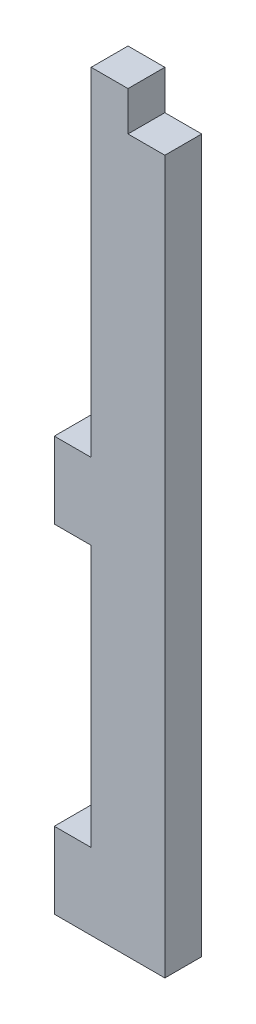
ISO-10303-21;
HEADER;
FILE_DESCRIPTION(('STEP AP214'),'2;1');
FILE_NAME('part.step','',(''),(''),'','','');
FILE_SCHEMA(('AUTOMOTIVE_DESIGN { 1 0 10303 214 1 1 1 1 }'));
ENDSEC;
DATA;
#1=APPLICATION_CONTEXT('core data for automotive mechanical design processes');
#2=APPLICATION_PROTOCOL_DEFINITION('international standard','automotive_design',2000,#1);
#3=PRODUCT_CONTEXT('',#1,'mechanical');
#4=PRODUCT('Part','Part','',(#3));
#5=PRODUCT_RELATED_PRODUCT_CATEGORY('part','',(#4));
#6=PRODUCT_DEFINITION_FORMATION('','',#4);
#7=PRODUCT_DEFINITION_CONTEXT('part definition',#1,'design');
#8=PRODUCT_DEFINITION('design','',#6,#7);
#9=PRODUCT_DEFINITION_SHAPE('','',#8);
#10=(LENGTH_UNIT() NAMED_UNIT(*) SI_UNIT(.MILLI.,.METRE.));
#11=(NAMED_UNIT(*) PLANE_ANGLE_UNIT() SI_UNIT($,.RADIAN.));
#12=(NAMED_UNIT(*) SI_UNIT($,.STERADIAN.) SOLID_ANGLE_UNIT());
#13=UNCERTAINTY_MEASURE_WITH_UNIT(LENGTH_MEASURE(1.E-05),#10,'distance_accuracy_value','');
#14=(GEOMETRIC_REPRESENTATION_CONTEXT(3) GLOBAL_UNCERTAINTY_ASSIGNED_CONTEXT((#13)) GLOBAL_UNIT_ASSIGNED_CONTEXT((#10,
#11,#12)) REPRESENTATION_CONTEXT('',''));
#15=CARTESIAN_POINT('',(0.,0.,0.));
#16=DIRECTION('',(0.,0.,1.));
#17=DIRECTION('',(1.,0.,0.));
#18=AXIS2_PLACEMENT_3D('',#15,#16,#17);
#19=CARTESIAN_POINT('',(0.,-68.9,3.));
#20=DIRECTION('',(0.,-1.,0.));
#21=DIRECTION('',(0.,0.,-1.));
#22=AXIS2_PLACEMENT_3D('',#19,#20,#21);
#23=PLANE('',#22);
#24=DIRECTION('',(-1.,0.,0.));
#25=VECTOR('',#24,1.);
#26=CARTESIAN_POINT('',(0.,-68.9,0.));
#27=LINE('',#26,#25);
#28=CARTESIAN_POINT('',(0.,-68.9,0.));
#29=VERTEX_POINT('',#28);
#30=CARTESIAN_POINT('',(-3.,-68.9,0.));
#31=VERTEX_POINT('',#30);
#32=EDGE_CURVE('E140',#29,#31,#27,.T.);
#33=ORIENTED_EDGE('',*,*,#32,.T.);
#34=DIRECTION('',(0.,0.,-1.));
#35=VECTOR('',#34,1.);
#36=CARTESIAN_POINT('',(-3.,-68.9,3.));
#37=LINE('',#36,#35);
#38=CARTESIAN_POINT('',(-3.,-68.9,3.));
#39=VERTEX_POINT('',#38);
#40=EDGE_CURVE('E11',#39,#31,#37,.T.);
#41=ORIENTED_EDGE('',*,*,#40,.F.);
#42=DIRECTION('',(-1.,0.,0.));
#43=VECTOR('',#42,1.);
#44=CARTESIAN_POINT('',(0.,-68.9,3.));
#45=LINE('',#44,#43);
#46=CARTESIAN_POINT('',(0.,-68.9,3.));
#47=VERTEX_POINT('',#46);
#48=EDGE_CURVE('E244',#47,#39,#45,.T.);
#49=ORIENTED_EDGE('',*,*,#48,.F.);
#50=DIRECTION('',(0.,0.,-1.));
#51=VECTOR('',#50,1.);
#52=CARTESIAN_POINT('',(0.,-68.9,3.));
#53=LINE('',#52,#51);
#54=EDGE_CURVE('E33',#47,#29,#53,.T.);
#55=ORIENTED_EDGE('',*,*,#54,.T.);
#56=EDGE_LOOP('',(#33,#41,#49,#55));
#57=FACE_BOUND('',#56,.T.);
#58=ADVANCED_FACE('F17',(#57),#23,.F.);
#59=CARTESIAN_POINT('',(-2.99999999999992,0.,3.));
#60=DIRECTION('',(1.,0.,0.));
#61=DIRECTION('',(0.,1.,0.));
#62=AXIS2_PLACEMENT_3D('',#59,#60,#61);
#63=PLANE('',#62);
#64=DIRECTION('',(0.,-1.,0.));
#65=VECTOR('',#64,1.);
#66=CARTESIAN_POINT('',(-2.99999999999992,0.,0.));
#67=LINE('',#66,#65);
#68=CARTESIAN_POINT('',(-3.,-75.1,0.));
#69=VERTEX_POINT('',#68);
#70=EDGE_CURVE('E142',#31,#69,#67,.T.);
#71=ORIENTED_EDGE('',*,*,#70,.T.);
#72=DIRECTION('',(0.,0.,-1.));
#73=VECTOR('',#72,1.);
#74=CARTESIAN_POINT('',(-3.,-75.1,3.));
#75=LINE('',#74,#73);
#76=CARTESIAN_POINT('',(-3.,-75.1,3.));
#77=VERTEX_POINT('',#76);
#78=EDGE_CURVE('E25',#77,#69,#75,.T.);
#79=ORIENTED_EDGE('',*,*,#78,.F.);
#80=DIRECTION('',(0.,-1.,0.));
#81=VECTOR('',#80,1.);
#82=CARTESIAN_POINT('',(-2.99999999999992,0.,3.));
#83=LINE('',#82,#81);
#84=EDGE_CURVE('E83',#39,#77,#83,.T.);
#85=ORIENTED_EDGE('',*,*,#84,.F.);
#86=ORIENTED_EDGE('',*,*,#40,.T.);
#87=EDGE_LOOP('',(#71,#79,#85,#86));
#88=FACE_BOUND('',#87,.T.);
#89=ADVANCED_FACE('F237',(#88),#63,.F.);
#90=CARTESIAN_POINT('',(0.,-75.1,3.));
#91=DIRECTION('',(0.,1.,0.));
#92=DIRECTION('',(0.,0.,1.));
#93=AXIS2_PLACEMENT_3D('',#90,#91,#92);
#94=PLANE('',#93);
#95=DIRECTION('',(1.,0.,0.));
#96=VECTOR('',#95,1.);
#97=CARTESIAN_POINT('',(0.,-75.1,0.));
#98=LINE('',#97,#96);
#99=CARTESIAN_POINT('',(6.,-75.1,0.));
#100=VERTEX_POINT('',#99);
#101=EDGE_CURVE('E144',#69,#100,#98,.T.);
#102=ORIENTED_EDGE('',*,*,#101,.T.);
#103=DIRECTION('',(0.,0.,-1.));
#104=VECTOR('',#103,1.);
#105=CARTESIAN_POINT('',(6.,-75.1,3.));
#106=LINE('',#105,#104);
#107=CARTESIAN_POINT('',(6.,-75.1,3.));
#108=VERTEX_POINT('',#107);
#109=EDGE_CURVE('E180',#108,#100,#106,.T.);
#110=ORIENTED_EDGE('',*,*,#109,.F.);
#111=DIRECTION('',(1.,0.,0.));
#112=VECTOR('',#111,1.);
#113=CARTESIAN_POINT('',(0.,-75.1,3.));
#114=LINE('',#113,#112);
#115=EDGE_CURVE('E188',#77,#108,#114,.T.);
#116=ORIENTED_EDGE('',*,*,#115,.F.);
#117=ORIENTED_EDGE('',*,*,#78,.T.);
#118=EDGE_LOOP('',(#102,#110,#116,#117));
#119=FACE_BOUND('',#118,.T.);
#120=ADVANCED_FACE('F186',(#119),#94,.F.);
#121=CARTESIAN_POINT('',(6.,0.,3.));
#122=DIRECTION('',(-1.,0.,0.));
#123=DIRECTION('',(0.,0.,1.));
#124=AXIS2_PLACEMENT_3D('',#121,#122,#123);
#125=PLANE('',#124);
#126=DIRECTION('',(0.,1.,0.));
#127=VECTOR('',#126,1.);
#128=CARTESIAN_POINT('',(6.,0.,0.));
#129=LINE('',#128,#127);
#130=CARTESIAN_POINT('',(6.,-17.1,0.));
#131=VERTEX_POINT('',#130);
#132=EDGE_CURVE('E146',#100,#131,#129,.T.);
#133=ORIENTED_EDGE('',*,*,#132,.T.);
#134=DIRECTION('',(0.,0.,-1.));
#135=VECTOR('',#134,1.);
#136=CARTESIAN_POINT('',(6.,-17.1,3.));
#137=LINE('',#136,#135);
#138=CARTESIAN_POINT('',(6.,-17.1,3.));
#139=VERTEX_POINT('',#138);
#140=EDGE_CURVE('E178',#139,#131,#137,.T.);
#141=ORIENTED_EDGE('',*,*,#140,.F.);
#142=DIRECTION('',(0.,1.,0.));
#143=VECTOR('',#142,1.);
#144=CARTESIAN_POINT('',(6.,0.,3.));
#145=LINE('',#144,#143);
#146=EDGE_CURVE('E199',#108,#139,#145,.T.);
#147=ORIENTED_EDGE('',*,*,#146,.F.);
#148=ORIENTED_EDGE('',*,*,#109,.T.);
#149=EDGE_LOOP('',(#133,#141,#147,#148));
#150=FACE_BOUND('',#149,.T.);
#151=ADVANCED_FACE('F196',(#150),#125,.F.);
#152=CARTESIAN_POINT('',(0.,-17.1,3.));
#153=DIRECTION('',(0.,1.,0.));
#154=DIRECTION('',(0.,0.,1.));
#155=AXIS2_PLACEMENT_3D('',#152,#153,#154);
#156=PLANE('',#155);
#157=DIRECTION('',(1.,0.,0.));
#158=VECTOR('',#157,1.);
#159=CARTESIAN_POINT('',(0.,-17.1,0.));
#160=LINE('',#159,#158);
#161=CARTESIAN_POINT('',(3.,-17.1,0.));
#162=VERTEX_POINT('',#161);
#163=EDGE_CURVE('E149',#162,#131,#160,.T.);
#164=ORIENTED_EDGE('',*,*,#163,.F.);
#165=DIRECTION('',(0.,0.,-1.));
#166=VECTOR('',#165,1.);
#167=CARTESIAN_POINT('',(3.,-17.1,3.));
#168=LINE('',#167,#166);
#169=CARTESIAN_POINT('',(3.,-17.1,3.));
#170=VERTEX_POINT('',#169);
#171=EDGE_CURVE('E176',#170,#162,#168,.T.);
#172=ORIENTED_EDGE('',*,*,#171,.F.);
#173=DIRECTION('',(1.,0.,0.));
#174=VECTOR('',#173,1.);
#175=CARTESIAN_POINT('',(0.,-17.1,3.));
#176=LINE('',#175,#174);
#177=EDGE_CURVE('E201',#170,#139,#176,.T.);
#178=ORIENTED_EDGE('',*,*,#177,.T.);
#179=ORIENTED_EDGE('',*,*,#140,.T.);
#180=EDGE_LOOP('',(#164,#172,#178,#179));
#181=FACE_BOUND('',#180,.T.);
#182=ADVANCED_FACE('F309',(#181),#156,.T.);
#183=CARTESIAN_POINT('',(3.,0.,3.));
#184=DIRECTION('',(-1.,0.,0.));
#185=DIRECTION('',(0.,0.,1.));
#186=AXIS2_PLACEMENT_3D('',#183,#184,#185);
#187=PLANE('',#186);
#188=DIRECTION('',(0.,1.,0.));
#189=VECTOR('',#188,1.);
#190=CARTESIAN_POINT('',(3.,0.,0.));
#191=LINE('',#190,#189);
#192=CARTESIAN_POINT('',(3.,-13.9,0.));
#193=VERTEX_POINT('',#192);
#194=EDGE_CURVE('E152',#162,#193,#191,.T.);
#195=ORIENTED_EDGE('',*,*,#194,.T.);
#196=DIRECTION('',(0.,0.,-1.));
#197=VECTOR('',#196,1.);
#198=CARTESIAN_POINT('',(3.,-13.9,3.));
#199=LINE('',#198,#197);
#200=CARTESIAN_POINT('',(3.,-13.9,3.));
#201=VERTEX_POINT('',#200);
#202=EDGE_CURVE('E174',#201,#193,#199,.T.);
#203=ORIENTED_EDGE('',*,*,#202,.F.);
#204=DIRECTION('',(0.,1.,0.));
#205=VECTOR('',#204,1.);
#206=CARTESIAN_POINT('',(3.,0.,3.));
#207=LINE('',#206,#205);
#208=EDGE_CURVE('E203',#170,#201,#207,.T.);
#209=ORIENTED_EDGE('',*,*,#208,.F.);
#210=ORIENTED_EDGE('',*,*,#171,.T.);
#211=EDGE_LOOP('',(#195,#203,#209,#210));
#212=FACE_BOUND('',#211,.T.);
#213=ADVANCED_FACE('F301',(#212),#187,.F.);
#214=CARTESIAN_POINT('',(0.,-13.9,3.));
#215=DIRECTION('',(0.,1.,0.));
#216=DIRECTION('',(0.,0.,1.));
#217=AXIS2_PLACEMENT_3D('',#214,#215,#216);
#218=PLANE('',#217);
#219=DIRECTION('',(1.,0.,0.));
#220=VECTOR('',#219,1.);
#221=CARTESIAN_POINT('',(0.,-13.9,0.));
#222=LINE('',#221,#220);
#223=CARTESIAN_POINT('',(0.,-13.9,0.));
#224=VERTEX_POINT('',#223);
#225=EDGE_CURVE('E155',#224,#193,#222,.T.);
#226=ORIENTED_EDGE('',*,*,#225,.F.);
#227=DIRECTION('',(0.,0.,-1.));
#228=VECTOR('',#227,1.);
#229=CARTESIAN_POINT('',(0.,-13.9,3.));
#230=LINE('',#229,#228);
#231=CARTESIAN_POINT('',(0.,-13.9,3.));
#232=VERTEX_POINT('',#231);
#233=EDGE_CURVE('E172',#232,#224,#230,.T.);
#234=ORIENTED_EDGE('',*,*,#233,.F.);
#235=DIRECTION('',(1.,0.,0.));
#236=VECTOR('',#235,1.);
#237=CARTESIAN_POINT('',(0.,-13.9,3.));
#238=LINE('',#237,#236);
#239=EDGE_CURVE('E209',#232,#201,#238,.T.);
#240=ORIENTED_EDGE('',*,*,#239,.T.);
#241=ORIENTED_EDGE('',*,*,#202,.T.);
#242=EDGE_LOOP('',(#226,#234,#240,#241));
#243=FACE_BOUND('',#242,.T.);
#244=ADVANCED_FACE('F220',(#243),#218,.T.);
#245=CARTESIAN_POINT('',(0.,0.,3.));
#246=DIRECTION('',(-1.,0.,0.));
#247=DIRECTION('',(0.,-1.,0.));
#248=AXIS2_PLACEMENT_3D('',#245,#246,#247);
#249=PLANE('',#248);
#250=DIRECTION('',(0.,1.,0.));
#251=VECTOR('',#250,1.);
#252=CARTESIAN_POINT('',(0.,0.,0.));
#253=LINE('',#252,#251);
#254=CARTESIAN_POINT('',(0.,-41.4,0.));
#255=VERTEX_POINT('',#254);
#256=EDGE_CURVE('E158',#255,#224,#253,.T.);
#257=ORIENTED_EDGE('',*,*,#256,.F.);
#258=DIRECTION('',(0.,0.,-1.));
#259=VECTOR('',#258,1.);
#260=CARTESIAN_POINT('',(0.,-41.4,3.));
#261=LINE('',#260,#259);
#262=CARTESIAN_POINT('',(0.,-41.4,3.));
#263=VERTEX_POINT('',#262);
#264=EDGE_CURVE('E170',#263,#255,#261,.T.);
#265=ORIENTED_EDGE('',*,*,#264,.F.);
#266=DIRECTION('',(0.,1.,0.));
#267=VECTOR('',#266,1.);
#268=CARTESIAN_POINT('',(0.,0.,3.));
#269=LINE('',#268,#267);
#270=EDGE_CURVE('E137',#263,#232,#269,.T.);
#271=ORIENTED_EDGE('',*,*,#270,.T.);
#272=ORIENTED_EDGE('',*,*,#233,.T.);
#273=EDGE_LOOP('',(#257,#265,#271,#272));
#274=FACE_BOUND('',#273,.T.);
#275=ADVANCED_FACE('F214',(#274),#249,.T.);
#276=CARTESIAN_POINT('',(0.,-41.4,3.));
#277=DIRECTION('',(0.,-1.,0.));
#278=DIRECTION('',(0.,0.,-1.));
#279=AXIS2_PLACEMENT_3D('',#276,#277,#278);
#280=PLANE('',#279);
#281=DIRECTION('',(-1.,0.,0.));
#282=VECTOR('',#281,1.);
#283=CARTESIAN_POINT('',(0.,-41.4,0.));
#284=LINE('',#283,#282);
#285=CARTESIAN_POINT('',(-3.,-41.4,0.));
#286=VERTEX_POINT('',#285);
#287=EDGE_CURVE('E161',#255,#286,#284,.T.);
#288=ORIENTED_EDGE('',*,*,#287,.T.);
#289=DIRECTION('',(0.,0.,-1.));
#290=VECTOR('',#289,1.);
#291=CARTESIAN_POINT('',(-3.,-41.4,3.));
#292=LINE('',#291,#290);
#293=CARTESIAN_POINT('',(-3.,-41.4,3.));
#294=VERTEX_POINT('',#293);
#295=EDGE_CURVE('E131',#294,#286,#292,.T.);
#296=ORIENTED_EDGE('',*,*,#295,.F.);
#297=DIRECTION('',(-1.,0.,0.));
#298=VECTOR('',#297,1.);
#299=CARTESIAN_POINT('',(0.,-41.4,3.));
#300=LINE('',#299,#298);
#301=EDGE_CURVE('E119',#263,#294,#300,.T.);
#302=ORIENTED_EDGE('',*,*,#301,.F.);
#303=ORIENTED_EDGE('',*,*,#264,.T.);
#304=EDGE_LOOP('',(#288,#296,#302,#303));
#305=FACE_BOUND('',#304,.T.);
#306=ADVANCED_FACE('F223',(#305),#280,.F.);
#307=CARTESIAN_POINT('',(-3.,0.,3.));
#308=DIRECTION('',(1.,0.,0.));
#309=DIRECTION('',(0.,1.,0.));
#310=AXIS2_PLACEMENT_3D('',#307,#308,#309);
#311=PLANE('',#310);
#312=DIRECTION('',(0.,-1.,0.));
#313=VECTOR('',#312,1.);
#314=CARTESIAN_POINT('',(-3.,0.,0.));
#315=LINE('',#314,#313);
#316=CARTESIAN_POINT('',(-3.,-47.6,0.));
#317=VERTEX_POINT('',#316);
#318=EDGE_CURVE('E128',#286,#317,#315,.T.);
#319=ORIENTED_EDGE('',*,*,#318,.T.);
#320=DIRECTION('',(0.,0.,-1.));
#321=VECTOR('',#320,1.);
#322=CARTESIAN_POINT('',(-3.,-47.6,3.));
#323=LINE('',#322,#321);
#324=CARTESIAN_POINT('',(-3.,-47.6,3.));
#325=VERTEX_POINT('',#324);
#326=EDGE_CURVE('E125',#325,#317,#323,.T.);
#327=ORIENTED_EDGE('',*,*,#326,.F.);
#328=DIRECTION('',(0.,-1.,0.));
#329=VECTOR('',#328,1.);
#330=CARTESIAN_POINT('',(-3.,0.,3.));
#331=LINE('',#330,#329);
#332=EDGE_CURVE('E111',#294,#325,#331,.T.);
#333=ORIENTED_EDGE('',*,*,#332,.F.);
#334=ORIENTED_EDGE('',*,*,#295,.T.);
#335=EDGE_LOOP('',(#319,#327,#333,#334));
#336=FACE_BOUND('',#335,.T.);
#337=ADVANCED_FACE('F126',(#336),#311,.F.);
#338=CARTESIAN_POINT('',(0.,-47.6,3.));
#339=DIRECTION('',(0.,-1.,0.));
#340=DIRECTION('',(0.,0.,-1.));
#341=AXIS2_PLACEMENT_3D('',#338,#339,#340);
#342=PLANE('',#341);
#343=DIRECTION('',(-1.,0.,0.));
#344=VECTOR('',#343,1.);
#345=CARTESIAN_POINT('',(0.,-47.6,0.));
#346=LINE('',#345,#344);
#347=CARTESIAN_POINT('',(0.,-47.6,0.));
#348=VERTEX_POINT('',#347);
#349=EDGE_CURVE('E165',#348,#317,#346,.T.);
#350=ORIENTED_EDGE('',*,*,#349,.F.);
#351=DIRECTION('',(0.,0.,-1.));
#352=VECTOR('',#351,1.);
#353=CARTESIAN_POINT('',(0.,-47.6,3.));
#354=LINE('',#353,#352);
#355=CARTESIAN_POINT('',(0.,-47.6,3.));
#356=VERTEX_POINT('',#355);
#357=EDGE_CURVE('E71',#356,#348,#354,.T.);
#358=ORIENTED_EDGE('',*,*,#357,.F.);
#359=DIRECTION('',(-1.,0.,0.));
#360=VECTOR('',#359,1.);
#361=CARTESIAN_POINT('',(0.,-47.6,3.));
#362=LINE('',#361,#360);
#363=EDGE_CURVE('E116',#356,#325,#362,.T.);
#364=ORIENTED_EDGE('',*,*,#363,.T.);
#365=ORIENTED_EDGE('',*,*,#326,.T.);
#366=EDGE_LOOP('',(#350,#358,#364,#365));
#367=FACE_BOUND('',#366,.T.);
#368=ADVANCED_FACE('F133',(#367),#342,.T.);
#369=EDGE_CURVE('E162',#29,#348,#253,.T.);
#370=ORIENTED_EDGE('',*,*,#369,.F.);
#371=ORIENTED_EDGE('',*,*,#54,.F.);
#372=EDGE_CURVE('E134',#47,#356,#269,.T.);
#373=ORIENTED_EDGE('',*,*,#372,.T.);
#374=ORIENTED_EDGE('',*,*,#357,.T.);
#375=EDGE_LOOP('',(#370,#371,#373,#374));
#376=FACE_BOUND('',#375,.T.);
#377=ADVANCED_FACE('F234',(#376),#249,.T.);
#378=CARTESIAN_POINT('',(0.,0.,3.));
#379=DIRECTION('',(0.,0.,1.));
#380=DIRECTION('',(1.,0.,0.));
#381=AXIS2_PLACEMENT_3D('',#378,#379,#380);
#382=PLANE('',#381);
#383=ORIENTED_EDGE('',*,*,#48,.T.);
#384=ORIENTED_EDGE('',*,*,#84,.T.);
#385=ORIENTED_EDGE('',*,*,#115,.T.);
#386=ORIENTED_EDGE('',*,*,#146,.T.);
#387=ORIENTED_EDGE('',*,*,#177,.F.);
#388=ORIENTED_EDGE('',*,*,#208,.T.);
#389=ORIENTED_EDGE('',*,*,#239,.F.);
#390=ORIENTED_EDGE('',*,*,#270,.F.);
#391=ORIENTED_EDGE('',*,*,#301,.T.);
#392=ORIENTED_EDGE('',*,*,#332,.T.);
#393=ORIENTED_EDGE('',*,*,#363,.F.);
#394=ORIENTED_EDGE('',*,*,#372,.F.);
#395=EDGE_LOOP('',(#383,#384,#385,#386,#387,#388,#389,#390,#391,#392,#393,#394));
#396=FACE_BOUND('',#395,.T.);
#397=ADVANCED_FACE('F113',(#396),#382,.T.);
#398=CARTESIAN_POINT('',(0.,0.,0.));
#399=DIRECTION('',(0.,0.,1.));
#400=DIRECTION('',(1.,0.,0.));
#401=AXIS2_PLACEMENT_3D('',#398,#399,#400);
#402=PLANE('',#401);
#403=ORIENTED_EDGE('',*,*,#32,.F.);
#404=ORIENTED_EDGE('',*,*,#369,.T.);
#405=ORIENTED_EDGE('',*,*,#349,.T.);
#406=ORIENTED_EDGE('',*,*,#318,.F.);
#407=ORIENTED_EDGE('',*,*,#287,.F.);
#408=ORIENTED_EDGE('',*,*,#256,.T.);
#409=ORIENTED_EDGE('',*,*,#225,.T.);
#410=ORIENTED_EDGE('',*,*,#194,.F.);
#411=ORIENTED_EDGE('',*,*,#163,.T.);
#412=ORIENTED_EDGE('',*,*,#132,.F.);
#413=ORIENTED_EDGE('',*,*,#101,.F.);
#414=ORIENTED_EDGE('',*,*,#70,.F.);
#415=EDGE_LOOP('',(#403,#404,#405,#406,#407,#408,#409,#410,#411,#412,#413,#414));
#416=FACE_BOUND('',#415,.T.);
#417=ADVANCED_FACE('F191',(#416),#402,.F.);
#418=CLOSED_SHELL('',(#58,#89,#120,#151,#182,#213,#244,#275,#306,#337,#368,#377,#397,#417));
#419=MANIFOLD_SOLID_BREP('B1',#418);
#420=ADVANCED_BREP_SHAPE_REPRESENTATION('',(#18,#419),#14);
#421=SHAPE_DEFINITION_REPRESENTATION(#9,#420);
ENDSEC;
END-ISO-10303-21;
